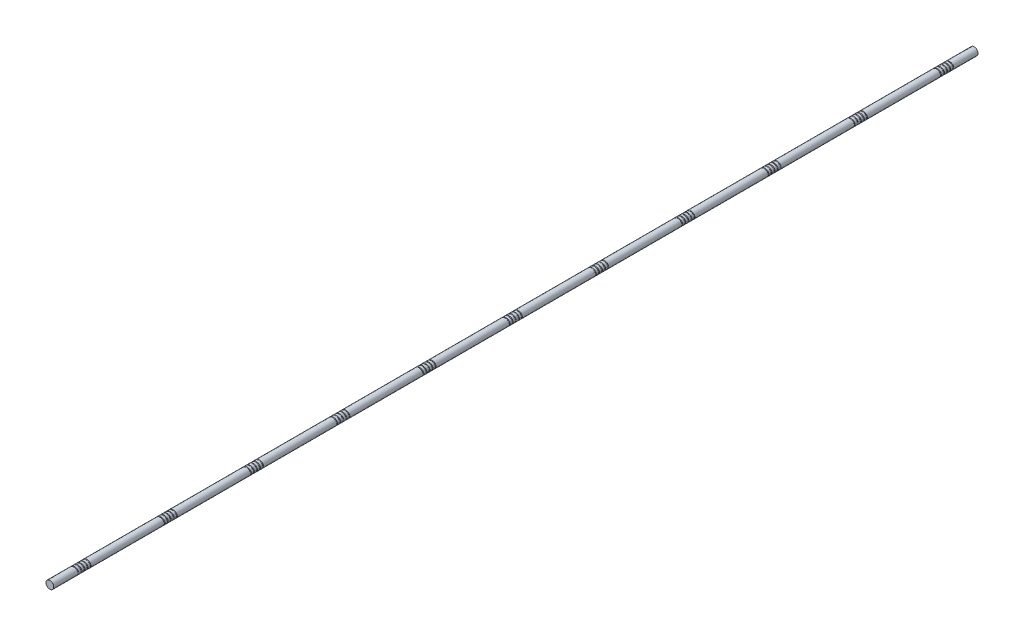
from build123d import *

# Parameters (mm, degrees)
SKETCH1_R              = 25
BOSS_EXTRUDE1_DEPTH    = 6000
CUT_SWEEP1_PITCH       = 20
CUT_SWEEP1_HEIGHT      = 100
CUT_SWEEP1_RADIUS      = 27.116666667
CUT_SWEEP1_START_ANGLE = -180
SKETCH3_R              = 3.175
LPATTERN1_COUNT        = 11
LPATTERN1_PITCH        = 560


with BuildPart() as part:
    # Sketch1 → Boss-Extrude1 (new body)
    with BuildSketch(Plane.XY):
        Circle(SKETCH1_R)
    extrude(amount=BOSS_EXTRUDE1_DEPTH)

    # Cut-Sweep1: sweep along a helix
    with BuildLine() as cut_sweep1_path:
        add(Helix(CUT_SWEEP1_PITCH, CUT_SWEEP1_HEIGHT, CUT_SWEEP1_RADIUS, center=(0, 0, 150), direction=(0, 0, 1), mode=Mode.PRIVATE).rotate(Axis((0, 0, 150), (0, 0, 1)), CUT_SWEEP1_START_ANGLE))
    # Sketch3 → Cut-Sweep1 (sweep, cut)
    with BuildSketch(Plane(origin=(0, 0, 0), x_dir=(1, 0, 0), z_dir=(0, 1, 0))):
        with Locations((-27.116666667, -150)):
            Circle(SKETCH3_R)
    cut_sweep1 = sweep(path=cut_sweep1_path.line, is_frenet=True, mode=Mode.SUBTRACT)

    # LPattern1: Cut-Sweep1 ×11
    with Locations(*[(0, 0, i * LPATTERN1_PITCH) for i in range(1, LPATTERN1_COUNT)]):
        add(cut_sweep1, mode=Mode.SUBTRACT)


solid = part.part
